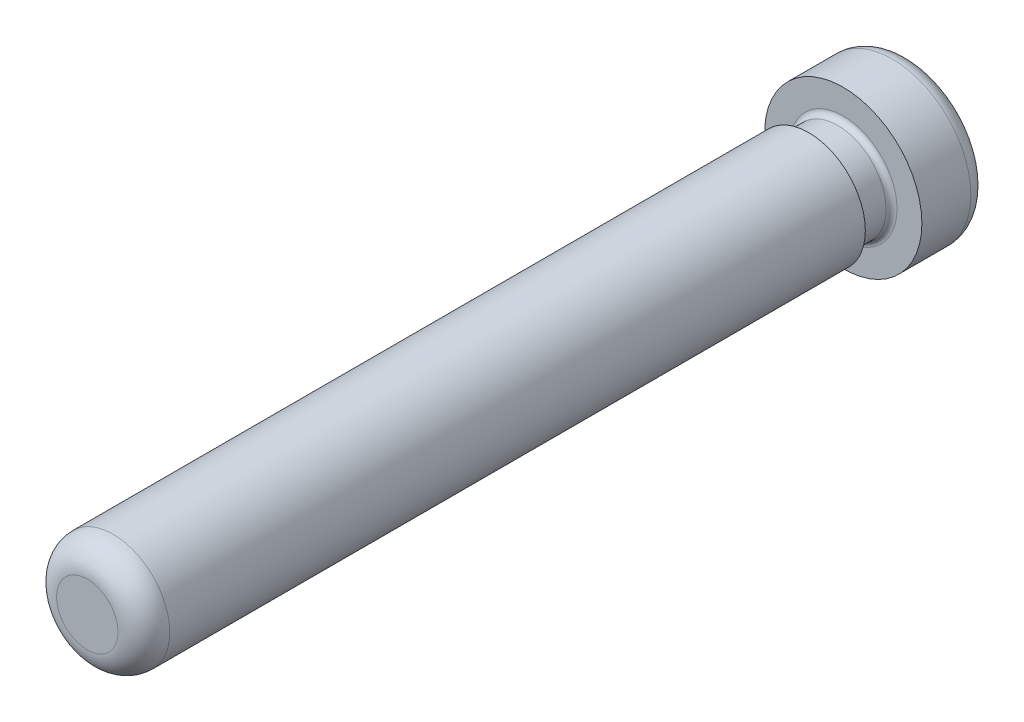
from build123d import *


with BuildPart() as part:
    # Sketch 1 → Revolve 1 (revolve)
    with BuildSketch(Plane(origin=(0, 0, 0), x_dir=(0, 0, -1), z_dir=(1, 0, 0)), mode=Mode.PRIVATE) as revolve_1_sk:
        with BuildLine():
            Line((0, 0), (37.846, 0))
            Line((37.846, 0), (37.846, 2.82575))
            ThreePointArc((37.846, 2.82575), (37.613516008, 3.387016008), (37.05225, 3.6195))
            Line((37.05225, 3.6195), (34.798, 3.6195))
            Line((34.798, 3.6195), (34.798, 2.4765))
            ThreePointArc((34.798, 2.4765), (34.723605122, 2.296894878), (34.544, 2.2225))
            Line((34.544, 2.2225), (33.4645, 2.2225))
            ThreePointArc((33.4645, 2.2225), (33.284894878, 2.296894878), (33.2105, 2.4765))
            Line((33.2105, 2.4765), (33.2105, 2.6035))
            Line((33.2105, 2.6035), (1.190625, 2.6035))
            ThreePointArc((1.190625, 2.6035), (0.348725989, 2.254774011), (0, 1.412875))
            Line((0, 1.412875), (0, 0))
        make_face()
    revolve(revolve_1_sk.sketch.rotate(Axis((0, 0, 0), (0, 0, -1)), 90), axis=Axis((0, 0, 0), (0, 0, -1)))


solid = part.part
